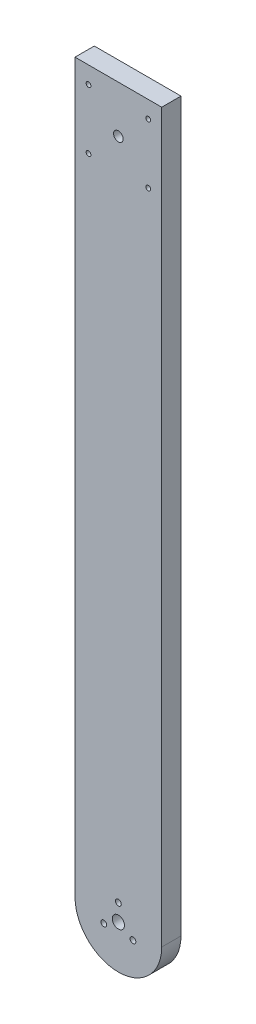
from build123d import *

# Parameters (mm, degrees)
SKETCH1_R           = 1.25
SKETCH1_R_2         = 2.5
SKETCH1_R_3         = 1.5
SKETCH1_R_4         = 3.15
BOSS_EXTRUDE1_DEPTH = 10


with BuildPart() as part:
    # Sketch1 → Boss-Extrude1 (new body)
    with BuildSketch(Plane.XY):
        with BuildLine():
            Line((-22.5, 130), (22.5, 130))
            Line((22.5, 130), (22.5, -247.5))
            ThreePointArc((22.5, -247.5), (0, -270), (-22.5, -247.5))
            Line((-22.5, -247.5), (-22.5, 130))
        make_face()
        with Locations((-15.5, 121.163920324)):
            Circle(SKETCH1_R, mode=Mode.SUBTRACT)
        with Locations(Location((15.5, 121.163920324, 0), (0, 0, 180))):
            Circle(SKETCH1_R, mode=Mode.SUBTRACT)
        with Locations((15.5, 90.163920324)):
            Circle(SKETCH1_R, mode=Mode.SUBTRACT)
        with Locations(Location((-15.5, 90.163920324, 0), (0, 0, 180))):
            Circle(SKETCH1_R, mode=Mode.SUBTRACT)
        with Locations((0, 105.663920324)):
            Circle(SKETCH1_R_2, mode=Mode.SUBTRACT)
        with Locations((0, -238.75)):
            Circle(SKETCH1_R_3, mode=Mode.SUBTRACT)
        with Locations((7.577722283, -251.875)):
            Circle(SKETCH1_R_3, mode=Mode.SUBTRACT)
        with Locations((-7.577722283, -251.875)):
            Circle(SKETCH1_R_3, mode=Mode.SUBTRACT)
        with Locations((0, -247.5)):
            Circle(SKETCH1_R_4, mode=Mode.SUBTRACT)
    extrude(amount=BOSS_EXTRUDE1_DEPTH)


solid = part.part
